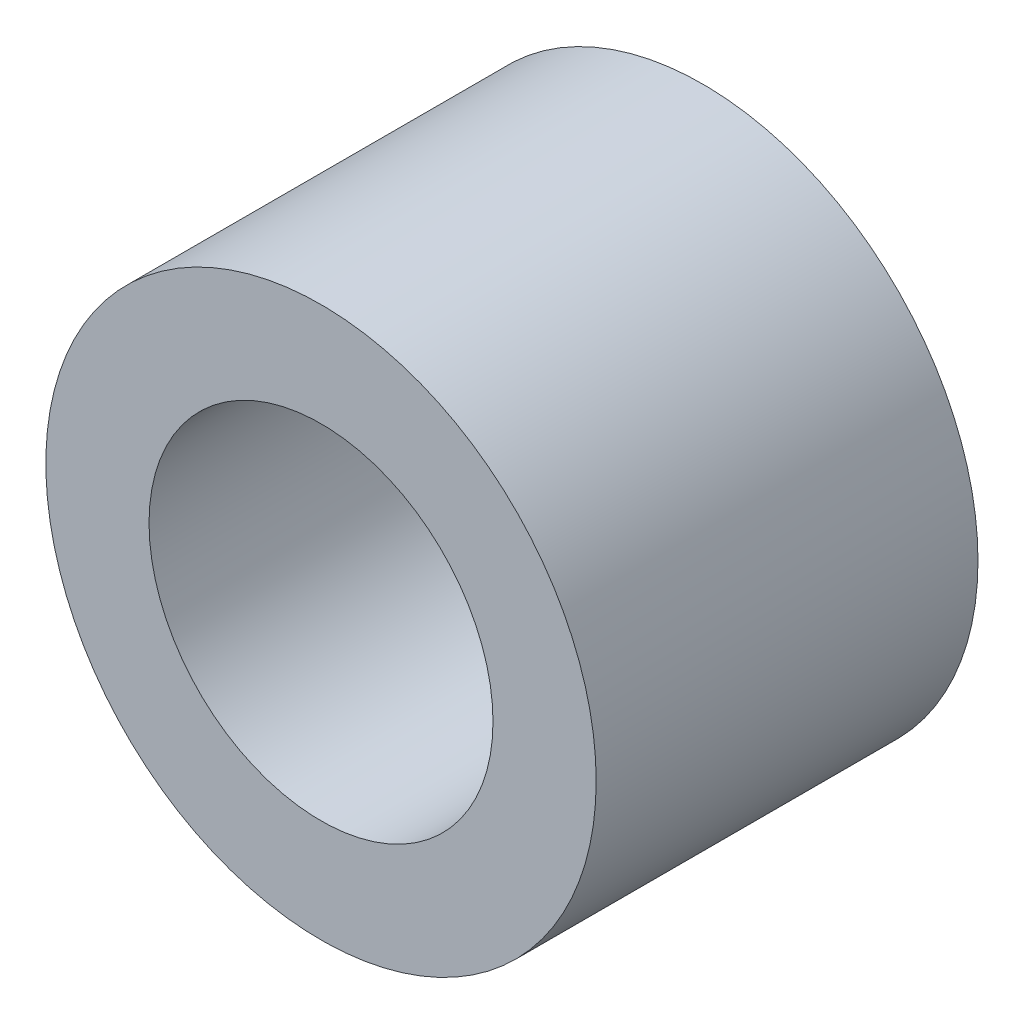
ISO-10303-21;
HEADER;
FILE_DESCRIPTION(('STEP AP214'),'2;1');
FILE_NAME('part.step','',(''),(''),'','','');
FILE_SCHEMA(('AUTOMOTIVE_DESIGN { 1 0 10303 214 1 1 1 1 }'));
ENDSEC;
DATA;
#1=APPLICATION_CONTEXT('core data for automotive mechanical design processes');
#2=APPLICATION_PROTOCOL_DEFINITION('international standard','automotive_design',2000,#1);
#3=PRODUCT_CONTEXT('',#1,'mechanical');
#4=PRODUCT('Part','Part','',(#3));
#5=PRODUCT_RELATED_PRODUCT_CATEGORY('part','',(#4));
#6=PRODUCT_DEFINITION_FORMATION('','',#4);
#7=PRODUCT_DEFINITION_CONTEXT('part definition',#1,'design');
#8=PRODUCT_DEFINITION('design','',#6,#7);
#9=PRODUCT_DEFINITION_SHAPE('','',#8);
#10=(LENGTH_UNIT() NAMED_UNIT(*) SI_UNIT(.MILLI.,.METRE.));
#11=(NAMED_UNIT(*) PLANE_ANGLE_UNIT() SI_UNIT($,.RADIAN.));
#12=(NAMED_UNIT(*) SI_UNIT($,.STERADIAN.) SOLID_ANGLE_UNIT());
#13=UNCERTAINTY_MEASURE_WITH_UNIT(LENGTH_MEASURE(1.E-05),#10,'distance_accuracy_value','');
#14=(GEOMETRIC_REPRESENTATION_CONTEXT(3) GLOBAL_UNCERTAINTY_ASSIGNED_CONTEXT((#13)) GLOBAL_UNIT_ASSIGNED_CONTEXT((#10,
#11,#12)) REPRESENTATION_CONTEXT('',''));
#15=CARTESIAN_POINT('',(0.,0.,0.));
#16=DIRECTION('',(0.,0.,1.));
#17=DIRECTION('',(1.,0.,0.));
#18=AXIS2_PLACEMENT_3D('',#15,#16,#17);
#19=CARTESIAN_POINT('',(0.,0.,55.5));
#20=DIRECTION('',(0.,0.,1.));
#21=DIRECTION('',(1.,0.,0.));
#22=AXIS2_PLACEMENT_3D('',#19,#20,#21);
#23=PLANE('',#22);
#24=CARTESIAN_POINT('',(0.,0.,55.5));
#25=DIRECTION('',(0.,0.,1.));
#26=DIRECTION('',(1.,0.,0.));
#27=AXIS2_PLACEMENT_3D('',#24,#25,#26);
#28=CIRCLE('',#27,40.);
#29=CARTESIAN_POINT('',(40.,0.,55.5));
#30=VERTEX_POINT('',#29);
#31=EDGE_CURVE('E11',#30,#30,#28,.T.);
#32=ORIENTED_EDGE('',*,*,#31,.T.);
#33=EDGE_LOOP('',(#32));
#34=FACE_BOUND('',#33,.T.);
#35=CARTESIAN_POINT('',(0.,0.,55.5));
#36=DIRECTION('',(0.,0.,1.));
#37=DIRECTION('',(1.,0.,0.));
#38=AXIS2_PLACEMENT_3D('',#35,#36,#37);
#39=CIRCLE('',#38,25.);
#40=CARTESIAN_POINT('',(25.,0.,55.5));
#41=VERTEX_POINT('',#40);
#42=EDGE_CURVE('E57',#41,#41,#39,.T.);
#43=ORIENTED_EDGE('',*,*,#42,.F.);
#44=EDGE_LOOP('',(#43));
#45=FACE_BOUND('',#44,.T.);
#46=ADVANCED_FACE('F41',(#34,#45),#23,.T.);
#47=CARTESIAN_POINT('',(0.,0.,0.));
#48=DIRECTION('',(0.,0.,1.));
#49=DIRECTION('',(1.,0.,0.));
#50=AXIS2_PLACEMENT_3D('',#47,#48,#49);
#51=PLANE('',#50);
#52=CARTESIAN_POINT('',(0.,0.,0.));
#53=DIRECTION('',(0.,0.,1.));
#54=DIRECTION('',(1.,0.,0.));
#55=AXIS2_PLACEMENT_3D('',#52,#53,#54);
#56=CIRCLE('',#55,40.);
#57=CARTESIAN_POINT('',(40.,0.,0.));
#58=VERTEX_POINT('',#57);
#59=EDGE_CURVE('E46',#58,#58,#56,.T.);
#60=ORIENTED_EDGE('',*,*,#59,.F.);
#61=EDGE_LOOP('',(#60));
#62=FACE_BOUND('',#61,.T.);
#63=CARTESIAN_POINT('',(0.,0.,0.));
#64=DIRECTION('',(0.,0.,1.));
#65=DIRECTION('',(1.,0.,0.));
#66=AXIS2_PLACEMENT_3D('',#63,#64,#65);
#67=CIRCLE('',#66,25.);
#68=CARTESIAN_POINT('',(25.,0.,0.));
#69=VERTEX_POINT('',#68);
#70=EDGE_CURVE('E59',#69,#69,#67,.T.);
#71=ORIENTED_EDGE('',*,*,#70,.T.);
#72=EDGE_LOOP('',(#71));
#73=FACE_BOUND('',#72,.T.);
#74=ADVANCED_FACE('F72',(#62,#73),#51,.F.);
#75=CARTESIAN_POINT('',(0.,0.,55.5));
#76=DIRECTION('',(0.,0.,-1.));
#77=DIRECTION('',(-1.,0.,0.));
#78=AXIS2_PLACEMENT_3D('',#75,#76,#77);
#79=CYLINDRICAL_SURFACE('',#78,40.);
#80=ORIENTED_EDGE('',*,*,#31,.F.);
#81=EDGE_LOOP('',(#80));
#82=FACE_BOUND('',#81,.T.);
#83=ORIENTED_EDGE('',*,*,#59,.T.);
#84=EDGE_LOOP('',(#83));
#85=FACE_BOUND('',#84,.T.);
#86=ADVANCED_FACE('F44',(#82,#85),#79,.T.);
#87=CARTESIAN_POINT('',(0.,0.,55.5));
#88=DIRECTION('',(0.,0.,-1.));
#89=DIRECTION('',(-1.,0.,0.));
#90=AXIS2_PLACEMENT_3D('',#87,#88,#89);
#91=CYLINDRICAL_SURFACE('',#90,25.);
#92=ORIENTED_EDGE('',*,*,#42,.T.);
#93=EDGE_LOOP('',(#92));
#94=FACE_BOUND('',#93,.T.);
#95=ORIENTED_EDGE('',*,*,#70,.F.);
#96=EDGE_LOOP('',(#95));
#97=FACE_BOUND('',#96,.T.);
#98=ADVANCED_FACE('F74',(#94,#97),#91,.F.);
#99=CLOSED_SHELL('',(#46,#74,#86,#98));
#100=MANIFOLD_SOLID_BREP('B2',#99);
#101=ADVANCED_BREP_SHAPE_REPRESENTATION('',(#18,#100),#14);
#102=SHAPE_DEFINITION_REPRESENTATION(#9,#101);
ENDSEC;
END-ISO-10303-21;
